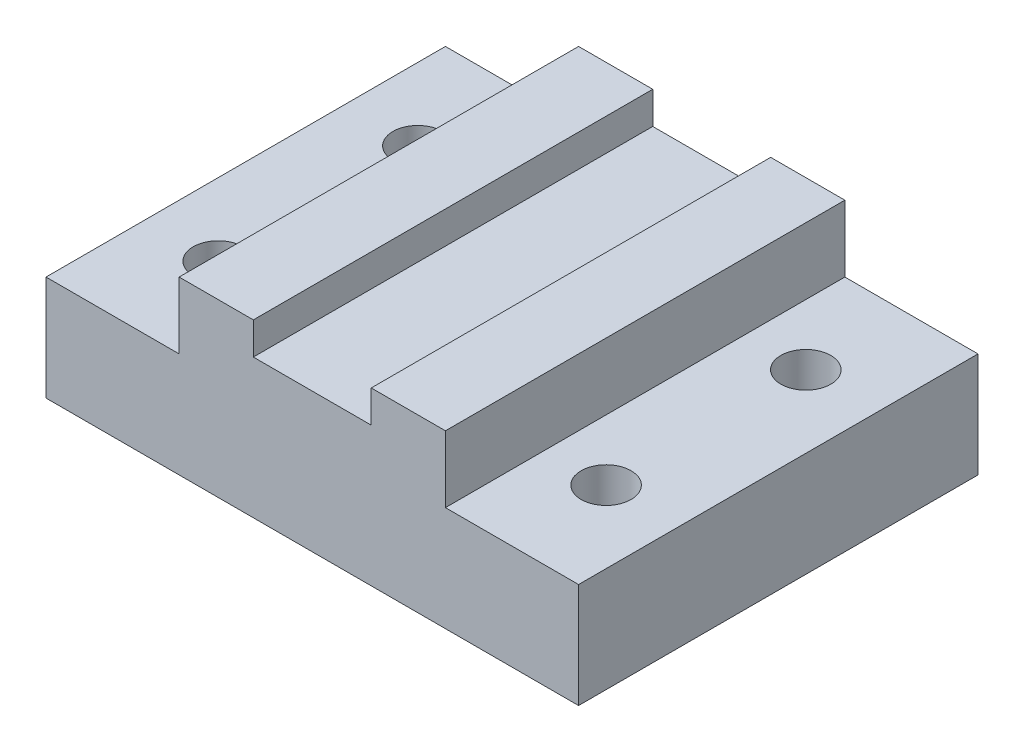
ISO-10303-21;
HEADER;
FILE_DESCRIPTION(('STEP AP214'),'2;1');
FILE_NAME('part.step','',(''),(''),'','','');
FILE_SCHEMA(('AUTOMOTIVE_DESIGN { 1 0 10303 214 1 1 1 1 }'));
ENDSEC;
DATA;
#1=APPLICATION_CONTEXT('core data for automotive mechanical design processes');
#2=APPLICATION_PROTOCOL_DEFINITION('international standard','automotive_design',2000,#1);
#3=PRODUCT_CONTEXT('',#1,'mechanical');
#4=PRODUCT('Part','Part','',(#3));
#5=PRODUCT_RELATED_PRODUCT_CATEGORY('part','',(#4));
#6=PRODUCT_DEFINITION_FORMATION('','',#4);
#7=PRODUCT_DEFINITION_CONTEXT('part definition',#1,'design');
#8=PRODUCT_DEFINITION('design','',#6,#7);
#9=PRODUCT_DEFINITION_SHAPE('','',#8);
#10=(LENGTH_UNIT() NAMED_UNIT(*) SI_UNIT(.MILLI.,.METRE.));
#11=(NAMED_UNIT(*) PLANE_ANGLE_UNIT() SI_UNIT($,.RADIAN.));
#12=(NAMED_UNIT(*) SI_UNIT($,.STERADIAN.) SOLID_ANGLE_UNIT());
#13=UNCERTAINTY_MEASURE_WITH_UNIT(LENGTH_MEASURE(1.E-05),#10,'distance_accuracy_value','');
#14=(GEOMETRIC_REPRESENTATION_CONTEXT(3) GLOBAL_UNCERTAINTY_ASSIGNED_CONTEXT((#13)) GLOBAL_UNIT_ASSIGNED_CONTEXT((#10,
#11,#12)) REPRESENTATION_CONTEXT('',''));
#15=CARTESIAN_POINT('',(0.,0.,0.));
#16=DIRECTION('',(0.,0.,1.));
#17=DIRECTION('',(1.,0.,0.));
#18=AXIS2_PLACEMENT_3D('',#15,#16,#17);
#19=CARTESIAN_POINT('',(50.8,65.4,-76.2));
#20=DIRECTION('',(0.,1.,0.));
#21=DIRECTION('',(-1.,0.,0.));
#22=AXIS2_PLACEMENT_3D('',#19,#20,#21);
#23=PLANE('',#22);
#24=DIRECTION('',(0.,0.,-1.));
#25=VECTOR('',#24,1.);
#26=CARTESIAN_POINT('',(22.4944704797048,65.4,-76.2));
#27=LINE('',#26,#25);
#28=CARTESIAN_POINT('',(22.4944704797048,65.4,76.2));
#29=VERTEX_POINT('',#28);
#30=CARTESIAN_POINT('',(22.4944704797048,65.4,-76.2));
#31=VERTEX_POINT('',#30);
#32=EDGE_CURVE('E11',#29,#31,#27,.T.);
#33=ORIENTED_EDGE('',*,*,#32,.F.);
#34=DIRECTION('',(1.,0.,0.));
#35=VECTOR('',#34,1.);
#36=CARTESIAN_POINT('',(50.8,65.4,76.2));
#37=LINE('',#36,#35);
#38=CARTESIAN_POINT('',(50.8,65.4,76.2));
#39=VERTEX_POINT('',#38);
#40=EDGE_CURVE('E252',#29,#39,#37,.T.);
#41=ORIENTED_EDGE('',*,*,#40,.T.);
#42=DIRECTION('',(0.,0.,-1.));
#43=VECTOR('',#42,1.);
#44=CARTESIAN_POINT('',(50.8,65.4,76.2));
#45=LINE('',#44,#43);
#46=CARTESIAN_POINT('',(50.8,65.4,-76.2));
#47=VERTEX_POINT('',#46);
#48=EDGE_CURVE('E257',#39,#47,#45,.T.);
#49=ORIENTED_EDGE('',*,*,#48,.T.);
#50=DIRECTION('',(-1.,0.,0.));
#51=VECTOR('',#50,1.);
#52=CARTESIAN_POINT('',(50.8,65.4,-76.2));
#53=LINE('',#52,#51);
#54=EDGE_CURVE('E255',#47,#31,#53,.T.);
#55=ORIENTED_EDGE('',*,*,#54,.T.);
#56=EDGE_LOOP('',(#33,#41,#49,#55));
#57=FACE_BOUND('',#56,.T.);
#58=ADVANCED_FACE('F29',(#57),#23,.T.);
#59=CARTESIAN_POINT('',(-101.6,40.,76.2));
#60=DIRECTION('',(0.,-1.,0.));
#61=DIRECTION('',(1.,0.,0.));
#62=AXIS2_PLACEMENT_3D('',#59,#60,#61);
#63=PLANE('',#62);
#64=CARTESIAN_POINT('',(74.0067888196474,40.,38.1));
#65=DIRECTION('',(0.,1.,0.));
#66=DIRECTION('',(1.,0.,0.));
#67=AXIS2_PLACEMENT_3D('',#64,#65,#66);
#68=CIRCLE('',#67,9.52500000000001);
#69=CARTESIAN_POINT('',(83.5317888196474,40.,38.1));
#70=VERTEX_POINT('',#69);
#71=EDGE_CURVE('E149',#70,#70,#68,.T.);
#72=ORIENTED_EDGE('',*,*,#71,.F.);
#73=EDGE_LOOP('',(#72));
#74=FACE_BOUND('',#73,.T.);
#75=CARTESIAN_POINT('',(74.0067888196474,40.,-38.1));
#76=DIRECTION('',(0.,1.,0.));
#77=DIRECTION('',(1.,0.,0.));
#78=AXIS2_PLACEMENT_3D('',#75,#76,#77);
#79=CIRCLE('',#78,9.52500000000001);
#80=CARTESIAN_POINT('',(83.5317888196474,40.,-38.1));
#81=VERTEX_POINT('',#80);
#82=EDGE_CURVE('E155',#81,#81,#79,.T.);
#83=ORIENTED_EDGE('',*,*,#82,.F.);
#84=EDGE_LOOP('',(#83));
#85=FACE_BOUND('',#84,.T.);
#86=DIRECTION('',(0.,0.,-1.));
#87=VECTOR('',#86,1.);
#88=CARTESIAN_POINT('',(50.8,40.,76.2));
#89=LINE('',#88,#87);
#90=CARTESIAN_POINT('',(50.8,40.,76.2));
#91=VERTEX_POINT('',#90);
#92=CARTESIAN_POINT('',(50.8,40.,-76.2));
#93=VERTEX_POINT('',#92);
#94=EDGE_CURVE('E52',#91,#93,#89,.T.);
#95=ORIENTED_EDGE('',*,*,#94,.F.);
#96=DIRECTION('',(-1.,0.,0.));
#97=VECTOR('',#96,1.);
#98=CARTESIAN_POINT('',(-101.6,40.,76.2));
#99=LINE('',#98,#97);
#100=CARTESIAN_POINT('',(101.6,40.,76.2));
#101=VERTEX_POINT('',#100);
#102=EDGE_CURVE('E226',#101,#91,#99,.T.);
#103=ORIENTED_EDGE('',*,*,#102,.F.);
#104=DIRECTION('',(0.,0.,-1.));
#105=VECTOR('',#104,1.);
#106=CARTESIAN_POINT('',(101.6,40.,76.2));
#107=LINE('',#106,#105);
#108=CARTESIAN_POINT('',(101.6,40.,-76.2));
#109=VERTEX_POINT('',#108);
#110=EDGE_CURVE('E197',#101,#109,#107,.T.);
#111=ORIENTED_EDGE('',*,*,#110,.T.);
#112=DIRECTION('',(-1.,0.,0.));
#113=VECTOR('',#112,1.);
#114=CARTESIAN_POINT('',(-101.6,40.,-76.2));
#115=LINE('',#114,#113);
#116=EDGE_CURVE('E201',#109,#93,#115,.T.);
#117=ORIENTED_EDGE('',*,*,#116,.T.);
#118=EDGE_LOOP('',(#95,#103,#111,#117));
#119=FACE_BOUND('',#118,.T.);
#120=ADVANCED_FACE('F281',(#74,#85,#119),#63,.F.);
#121=CARTESIAN_POINT('',(-74.0067888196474,40.,-38.1));
#122=DIRECTION('',(0.,1.,0.));
#123=DIRECTION('',(-1.,0.,0.));
#124=AXIS2_PLACEMENT_3D('',#121,#122,#123);
#125=CIRCLE('',#124,9.52500000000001);
#126=CARTESIAN_POINT('',(-83.5317888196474,40.,-38.1));
#127=VERTEX_POINT('',#126);
#128=EDGE_CURVE('E161',#127,#127,#125,.T.);
#129=ORIENTED_EDGE('',*,*,#128,.F.);
#130=EDGE_LOOP('',(#129));
#131=FACE_BOUND('',#130,.T.);
#132=CARTESIAN_POINT('',(-74.0067888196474,40.,38.1));
#133=DIRECTION('',(0.,1.,0.));
#134=DIRECTION('',(-1.,0.,0.));
#135=AXIS2_PLACEMENT_3D('',#132,#133,#134);
#136=CIRCLE('',#135,9.52500000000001);
#137=CARTESIAN_POINT('',(-83.5317888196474,40.,38.1));
#138=VERTEX_POINT('',#137);
#139=EDGE_CURVE('E167',#138,#138,#136,.T.);
#140=ORIENTED_EDGE('',*,*,#139,.F.);
#141=EDGE_LOOP('',(#140));
#142=FACE_BOUND('',#141,.T.);
#143=DIRECTION('',(0.,0.,1.));
#144=VECTOR('',#143,1.);
#145=CARTESIAN_POINT('',(-50.8,40.,76.2));
#146=LINE('',#145,#144);
#147=CARTESIAN_POINT('',(-50.8,40.,-76.2));
#148=VERTEX_POINT('',#147);
#149=CARTESIAN_POINT('',(-50.8,40.,76.2));
#150=VERTEX_POINT('',#149);
#151=EDGE_CURVE('E180',#148,#150,#146,.T.);
#152=ORIENTED_EDGE('',*,*,#151,.F.);
#153=CARTESIAN_POINT('',(-101.6,40.,-76.2));
#154=VERTEX_POINT('',#153);
#155=EDGE_CURVE('E205',#148,#154,#115,.T.);
#156=ORIENTED_EDGE('',*,*,#155,.T.);
#157=DIRECTION('',(0.,0.,-1.));
#158=VECTOR('',#157,1.);
#159=CARTESIAN_POINT('',(-101.6,40.,76.2));
#160=LINE('',#159,#158);
#161=CARTESIAN_POINT('',(-101.6,40.,76.2));
#162=VERTEX_POINT('',#161);
#163=EDGE_CURVE('E222',#162,#154,#160,.T.);
#164=ORIENTED_EDGE('',*,*,#163,.F.);
#165=EDGE_CURVE('E219',#150,#162,#99,.T.);
#166=ORIENTED_EDGE('',*,*,#165,.F.);
#167=EDGE_LOOP('',(#152,#156,#164,#166));
#168=FACE_BOUND('',#167,.T.);
#169=ADVANCED_FACE('F239',(#131,#142,#168),#63,.F.);
#170=CARTESIAN_POINT('',(-101.6,0.,76.2));
#171=DIRECTION('',(1.,0.,0.));
#172=DIRECTION('',(0.,0.,-1.));
#173=AXIS2_PLACEMENT_3D('',#170,#171,#172);
#174=PLANE('',#173);
#175=DIRECTION('',(0.,-1.,0.));
#176=VECTOR('',#175,1.);
#177=CARTESIAN_POINT('',(-101.6,0.,-76.2));
#178=LINE('',#177,#176);
#179=CARTESIAN_POINT('',(-101.6,0.,-76.2));
#180=VERTEX_POINT('',#179);
#181=EDGE_CURVE('E243',#154,#180,#178,.T.);
#182=ORIENTED_EDGE('',*,*,#181,.T.);
#183=DIRECTION('',(0.,0.,-1.));
#184=VECTOR('',#183,1.);
#185=CARTESIAN_POINT('',(-101.6,0.,76.2));
#186=LINE('',#185,#184);
#187=CARTESIAN_POINT('',(-101.6,0.,76.2));
#188=VERTEX_POINT('',#187);
#189=EDGE_CURVE('E189',#188,#180,#186,.T.);
#190=ORIENTED_EDGE('',*,*,#189,.F.);
#191=DIRECTION('',(0.,-1.,0.));
#192=VECTOR('',#191,1.);
#193=CARTESIAN_POINT('',(-101.6,0.,76.2));
#194=LINE('',#193,#192);
#195=EDGE_CURVE('E204',#162,#188,#194,.T.);
#196=ORIENTED_EDGE('',*,*,#195,.F.);
#197=ORIENTED_EDGE('',*,*,#163,.T.);
#198=EDGE_LOOP('',(#182,#190,#196,#197));
#199=FACE_BOUND('',#198,.T.);
#200=ADVANCED_FACE('F31',(#199),#174,.F.);
#201=CARTESIAN_POINT('',(-101.6,0.,76.2));
#202=DIRECTION('',(0.,1.,0.));
#203=DIRECTION('',(-1.,0.,0.));
#204=AXIS2_PLACEMENT_3D('',#201,#202,#203);
#205=PLANE('',#204);
#206=CARTESIAN_POINT('',(74.0067888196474,0.,38.1));
#207=DIRECTION('',(0.,1.,0.));
#208=DIRECTION('',(1.,0.,0.));
#209=AXIS2_PLACEMENT_3D('',#206,#207,#208);
#210=CIRCLE('',#209,9.52500000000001);
#211=CARTESIAN_POINT('',(83.5317888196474,0.,38.1));
#212=VERTEX_POINT('',#211);
#213=EDGE_CURVE('E152',#212,#212,#210,.T.);
#214=ORIENTED_EDGE('',*,*,#213,.T.);
#215=EDGE_LOOP('',(#214));
#216=FACE_BOUND('',#215,.T.);
#217=CARTESIAN_POINT('',(74.0067888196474,0.,-38.1));
#218=DIRECTION('',(0.,1.,0.));
#219=DIRECTION('',(1.,0.,0.));
#220=AXIS2_PLACEMENT_3D('',#217,#218,#219);
#221=CIRCLE('',#220,9.52500000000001);
#222=CARTESIAN_POINT('',(83.5317888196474,0.,-38.1));
#223=VERTEX_POINT('',#222);
#224=EDGE_CURVE('E158',#223,#223,#221,.T.);
#225=ORIENTED_EDGE('',*,*,#224,.T.);
#226=EDGE_LOOP('',(#225));
#227=FACE_BOUND('',#226,.T.);
#228=CARTESIAN_POINT('',(-74.0067888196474,0.,-38.1));
#229=DIRECTION('',(0.,1.,0.));
#230=DIRECTION('',(-1.,0.,0.));
#231=AXIS2_PLACEMENT_3D('',#228,#229,#230);
#232=CIRCLE('',#231,9.52500000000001);
#233=CARTESIAN_POINT('',(-83.5317888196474,0.,-38.1));
#234=VERTEX_POINT('',#233);
#235=EDGE_CURVE('E164',#234,#234,#232,.T.);
#236=ORIENTED_EDGE('',*,*,#235,.T.);
#237=EDGE_LOOP('',(#236));
#238=FACE_BOUND('',#237,.T.);
#239=CARTESIAN_POINT('',(-74.0067888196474,0.,38.1));
#240=DIRECTION('',(0.,1.,0.));
#241=DIRECTION('',(-1.,0.,0.));
#242=AXIS2_PLACEMENT_3D('',#239,#240,#241);
#243=CIRCLE('',#242,9.52500000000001);
#244=CARTESIAN_POINT('',(-83.5317888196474,0.,38.1));
#245=VERTEX_POINT('',#244);
#246=EDGE_CURVE('E170',#245,#245,#243,.T.);
#247=ORIENTED_EDGE('',*,*,#246,.T.);
#248=EDGE_LOOP('',(#247));
#249=FACE_BOUND('',#248,.T.);
#250=DIRECTION('',(1.,0.,0.));
#251=VECTOR('',#250,1.);
#252=CARTESIAN_POINT('',(-101.6,0.,-76.2));
#253=LINE('',#252,#251);
#254=CARTESIAN_POINT('',(101.6,0.,-76.2));
#255=VERTEX_POINT('',#254);
#256=EDGE_CURVE('E244',#180,#255,#253,.T.);
#257=ORIENTED_EDGE('',*,*,#256,.T.);
#258=DIRECTION('',(0.,0.,-1.));
#259=VECTOR('',#258,1.);
#260=CARTESIAN_POINT('',(101.6,0.,76.2));
#261=LINE('',#260,#259);
#262=CARTESIAN_POINT('',(101.6,0.,76.2));
#263=VERTEX_POINT('',#262);
#264=EDGE_CURVE('E191',#263,#255,#261,.T.);
#265=ORIENTED_EDGE('',*,*,#264,.F.);
#266=DIRECTION('',(1.,0.,0.));
#267=VECTOR('',#266,1.);
#268=CARTESIAN_POINT('',(-101.6,0.,76.2));
#269=LINE('',#268,#267);
#270=EDGE_CURVE('E215',#188,#263,#269,.T.);
#271=ORIENTED_EDGE('',*,*,#270,.F.);
#272=ORIENTED_EDGE('',*,*,#189,.T.);
#273=EDGE_LOOP('',(#257,#265,#271,#272));
#274=FACE_BOUND('',#273,.T.);
#275=ADVANCED_FACE('F336',(#216,#227,#238,#249,#274),#205,.F.);
#276=CARTESIAN_POINT('',(101.6,0.,76.2));
#277=DIRECTION('',(-1.,0.,0.));
#278=DIRECTION('',(0.,-1.,0.));
#279=AXIS2_PLACEMENT_3D('',#276,#277,#278);
#280=PLANE('',#279);
#281=DIRECTION('',(0.,1.,0.));
#282=VECTOR('',#281,1.);
#283=CARTESIAN_POINT('',(101.6,0.,-76.2));
#284=LINE('',#283,#282);
#285=EDGE_CURVE('E210',#255,#109,#284,.T.);
#286=ORIENTED_EDGE('',*,*,#285,.T.);
#287=ORIENTED_EDGE('',*,*,#110,.F.);
#288=DIRECTION('',(0.,1.,0.));
#289=VECTOR('',#288,1.);
#290=CARTESIAN_POINT('',(101.6,0.,76.2));
#291=LINE('',#290,#289);
#292=EDGE_CURVE('E217',#263,#101,#291,.T.);
#293=ORIENTED_EDGE('',*,*,#292,.F.);
#294=ORIENTED_EDGE('',*,*,#264,.T.);
#295=EDGE_LOOP('',(#286,#287,#293,#294));
#296=FACE_BOUND('',#295,.T.);
#297=ADVANCED_FACE('F277',(#296),#280,.F.);
#298=CARTESIAN_POINT('',(-101.6,40.,76.2));
#299=DIRECTION('',(0.,0.,-1.));
#300=DIRECTION('',(-1.,0.,0.));
#301=AXIS2_PLACEMENT_3D('',#298,#299,#300);
#302=PLANE('',#301);
#303=ORIENTED_EDGE('',*,*,#40,.F.);
#304=DIRECTION('',(0.,-1.,0.));
#305=VECTOR('',#304,1.);
#306=CARTESIAN_POINT('',(22.4944704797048,40.,76.2));
#307=LINE('',#306,#305);
#308=CARTESIAN_POINT('',(22.4944704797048,53.1116616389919,76.2));
#309=VERTEX_POINT('',#308);
#310=EDGE_CURVE('E146',#29,#309,#307,.T.);
#311=ORIENTED_EDGE('',*,*,#310,.T.);
#312=DIRECTION('',(-1.,0.,0.));
#313=VECTOR('',#312,1.);
#314=CARTESIAN_POINT('',(-101.6,53.1116616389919,76.2));
#315=LINE('',#314,#313);
#316=CARTESIAN_POINT('',(-22.4944704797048,53.1116616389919,76.2));
#317=VERTEX_POINT('',#316);
#318=EDGE_CURVE('E125',#309,#317,#315,.T.);
#319=ORIENTED_EDGE('',*,*,#318,.T.);
#320=DIRECTION('',(0.,1.,0.));
#321=VECTOR('',#320,1.);
#322=CARTESIAN_POINT('',(-22.4944704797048,40.,76.2));
#323=LINE('',#322,#321);
#324=CARTESIAN_POINT('',(-22.4944704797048,65.4,76.2));
#325=VERTEX_POINT('',#324);
#326=EDGE_CURVE('E142',#317,#325,#323,.T.);
#327=ORIENTED_EDGE('',*,*,#326,.T.);
#328=CARTESIAN_POINT('',(-50.8,65.4,76.2));
#329=VERTEX_POINT('',#328);
#330=EDGE_CURVE('E187',#329,#325,#37,.T.);
#331=ORIENTED_EDGE('',*,*,#330,.F.);
#332=DIRECTION('',(0.,-1.,0.));
#333=VECTOR('',#332,1.);
#334=CARTESIAN_POINT('',(-50.8,65.4,76.2));
#335=LINE('',#334,#333);
#336=EDGE_CURVE('E186',#329,#150,#335,.T.);
#337=ORIENTED_EDGE('',*,*,#336,.T.);
#338=ORIENTED_EDGE('',*,*,#165,.T.);
#339=ORIENTED_EDGE('',*,*,#195,.T.);
#340=ORIENTED_EDGE('',*,*,#270,.T.);
#341=ORIENTED_EDGE('',*,*,#292,.T.);
#342=ORIENTED_EDGE('',*,*,#102,.T.);
#343=DIRECTION('',(0.,-1.,0.));
#344=VECTOR('',#343,1.);
#345=CARTESIAN_POINT('',(50.8,65.4,76.2));
#346=LINE('',#345,#344);
#347=EDGE_CURVE('E183',#39,#91,#346,.T.);
#348=ORIENTED_EDGE('',*,*,#347,.F.);
#349=EDGE_LOOP('',(#303,#311,#319,#327,#331,#337,#338,#339,#340,#341,#342,#348));
#350=FACE_BOUND('',#349,.T.);
#351=ADVANCED_FACE('F233',(#350),#302,.F.);
#352=CARTESIAN_POINT('',(-101.6,40.,-76.2));
#353=DIRECTION('',(0.,0.,-1.));
#354=DIRECTION('',(-1.,0.,0.));
#355=AXIS2_PLACEMENT_3D('',#352,#353,#354);
#356=PLANE('',#355);
#357=DIRECTION('',(0.,-1.,0.));
#358=VECTOR('',#357,1.);
#359=CARTESIAN_POINT('',(22.4944704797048,65.4,-76.2));
#360=LINE('',#359,#358);
#361=CARTESIAN_POINT('',(22.4944704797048,53.1116616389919,-76.2));
#362=VERTEX_POINT('',#361);
#363=EDGE_CURVE('E131',#31,#362,#360,.T.);
#364=ORIENTED_EDGE('',*,*,#363,.F.);
#365=ORIENTED_EDGE('',*,*,#54,.F.);
#366=DIRECTION('',(0.,-1.,0.));
#367=VECTOR('',#366,1.);
#368=CARTESIAN_POINT('',(50.8,65.4,-76.2));
#369=LINE('',#368,#367);
#370=EDGE_CURVE('E245',#47,#93,#369,.T.);
#371=ORIENTED_EDGE('',*,*,#370,.T.);
#372=ORIENTED_EDGE('',*,*,#116,.F.);
#373=ORIENTED_EDGE('',*,*,#285,.F.);
#374=ORIENTED_EDGE('',*,*,#256,.F.);
#375=ORIENTED_EDGE('',*,*,#181,.F.);
#376=ORIENTED_EDGE('',*,*,#155,.F.);
#377=DIRECTION('',(0.,-1.,0.));
#378=VECTOR('',#377,1.);
#379=CARTESIAN_POINT('',(-50.8,65.4,-76.2));
#380=LINE('',#379,#378);
#381=CARTESIAN_POINT('',(-50.8,65.4,-76.2));
#382=VERTEX_POINT('',#381);
#383=EDGE_CURVE('E248',#382,#148,#380,.T.);
#384=ORIENTED_EDGE('',*,*,#383,.F.);
#385=CARTESIAN_POINT('',(-22.4944704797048,65.4,-76.2));
#386=VERTEX_POINT('',#385);
#387=EDGE_CURVE('E256',#386,#382,#53,.T.);
#388=ORIENTED_EDGE('',*,*,#387,.F.);
#389=DIRECTION('',(0.,1.,0.));
#390=VECTOR('',#389,1.);
#391=CARTESIAN_POINT('',(-22.4944704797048,65.4,-76.2));
#392=LINE('',#391,#390);
#393=CARTESIAN_POINT('',(-22.4944704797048,53.1116616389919,-76.2));
#394=VERTEX_POINT('',#393);
#395=EDGE_CURVE('E44',#394,#386,#392,.T.);
#396=ORIENTED_EDGE('',*,*,#395,.F.);
#397=DIRECTION('',(-1.,0.,0.));
#398=VECTOR('',#397,1.);
#399=CARTESIAN_POINT('',(22.4944704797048,53.1116616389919,-76.2));
#400=LINE('',#399,#398);
#401=EDGE_CURVE('E123',#362,#394,#400,.T.);
#402=ORIENTED_EDGE('',*,*,#401,.F.);
#403=EDGE_LOOP('',(#364,#365,#371,#372,#373,#374,#375,#376,#384,#388,#396,#402));
#404=FACE_BOUND('',#403,.T.);
#405=ADVANCED_FACE('F137',(#404),#356,.T.);
#406=CARTESIAN_POINT('',(50.8,65.4,76.2));
#407=DIRECTION('',(-1.,0.,0.));
#408=DIRECTION('',(0.,-1.,0.));
#409=AXIS2_PLACEMENT_3D('',#406,#407,#408);
#410=PLANE('',#409);
#411=ORIENTED_EDGE('',*,*,#94,.T.);
#412=ORIENTED_EDGE('',*,*,#370,.F.);
#413=ORIENTED_EDGE('',*,*,#48,.F.);
#414=ORIENTED_EDGE('',*,*,#347,.T.);
#415=EDGE_LOOP('',(#411,#412,#413,#414));
#416=FACE_BOUND('',#415,.T.);
#417=ADVANCED_FACE('F283',(#416),#410,.F.);
#418=CARTESIAN_POINT('',(-50.8,65.4,76.2));
#419=DIRECTION('',(1.,0.,0.));
#420=DIRECTION('',(0.,1.,0.));
#421=AXIS2_PLACEMENT_3D('',#418,#419,#420);
#422=PLANE('',#421);
#423=ORIENTED_EDGE('',*,*,#151,.T.);
#424=ORIENTED_EDGE('',*,*,#336,.F.);
#425=DIRECTION('',(0.,0.,1.));
#426=VECTOR('',#425,1.);
#427=CARTESIAN_POINT('',(-50.8,65.4,76.2));
#428=LINE('',#427,#426);
#429=EDGE_CURVE('E253',#382,#329,#428,.T.);
#430=ORIENTED_EDGE('',*,*,#429,.F.);
#431=ORIENTED_EDGE('',*,*,#383,.T.);
#432=EDGE_LOOP('',(#423,#424,#430,#431));
#433=FACE_BOUND('',#432,.T.);
#434=ADVANCED_FACE('F272',(#433),#422,.F.);
#435=DIRECTION('',(0.,0.,1.));
#436=VECTOR('',#435,1.);
#437=CARTESIAN_POINT('',(-22.4944704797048,65.4,-76.2));
#438=LINE('',#437,#436);
#439=EDGE_CURVE('E37',#386,#325,#438,.T.);
#440=ORIENTED_EDGE('',*,*,#439,.F.);
#441=ORIENTED_EDGE('',*,*,#387,.T.);
#442=ORIENTED_EDGE('',*,*,#429,.T.);
#443=ORIENTED_EDGE('',*,*,#330,.T.);
#444=EDGE_LOOP('',(#440,#441,#442,#443));
#445=FACE_BOUND('',#444,.T.);
#446=ADVANCED_FACE('F286',(#445),#23,.T.);
#447=CARTESIAN_POINT('',(-74.0067888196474,0.,38.1));
#448=DIRECTION('',(0.,1.,0.));
#449=DIRECTION('',(-1.,0.,0.));
#450=AXIS2_PLACEMENT_3D('',#447,#448,#449);
#451=CYLINDRICAL_SURFACE('',#450,9.52500000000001);
#452=ORIENTED_EDGE('',*,*,#246,.F.);
#453=EDGE_LOOP('',(#452));
#454=FACE_BOUND('',#453,.T.);
#455=ORIENTED_EDGE('',*,*,#139,.T.);
#456=EDGE_LOOP('',(#455));
#457=FACE_BOUND('',#456,.T.);
#458=ADVANCED_FACE('F295',(#454,#457),#451,.F.);
#459=CARTESIAN_POINT('',(-74.0067888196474,0.,-38.1));
#460=DIRECTION('',(0.,1.,0.));
#461=DIRECTION('',(-1.,0.,0.));
#462=AXIS2_PLACEMENT_3D('',#459,#460,#461);
#463=CYLINDRICAL_SURFACE('',#462,9.52500000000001);
#464=ORIENTED_EDGE('',*,*,#235,.F.);
#465=EDGE_LOOP('',(#464));
#466=FACE_BOUND('',#465,.T.);
#467=ORIENTED_EDGE('',*,*,#128,.T.);
#468=EDGE_LOOP('',(#467));
#469=FACE_BOUND('',#468,.T.);
#470=ADVANCED_FACE('F301',(#466,#469),#463,.F.);
#471=CARTESIAN_POINT('',(74.0067888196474,0.,-38.1));
#472=DIRECTION('',(0.,1.,0.));
#473=DIRECTION('',(-1.,0.,0.));
#474=AXIS2_PLACEMENT_3D('',#471,#472,#473);
#475=CYLINDRICAL_SURFACE('',#474,9.52500000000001);
#476=ORIENTED_EDGE('',*,*,#224,.F.);
#477=EDGE_LOOP('',(#476));
#478=FACE_BOUND('',#477,.T.);
#479=ORIENTED_EDGE('',*,*,#82,.T.);
#480=EDGE_LOOP('',(#479));
#481=FACE_BOUND('',#480,.T.);
#482=ADVANCED_FACE('F316',(#478,#481),#475,.F.);
#483=CARTESIAN_POINT('',(74.0067888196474,0.,38.1));
#484=DIRECTION('',(0.,1.,0.));
#485=DIRECTION('',(-1.,0.,0.));
#486=AXIS2_PLACEMENT_3D('',#483,#484,#485);
#487=CYLINDRICAL_SURFACE('',#486,9.52500000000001);
#488=ORIENTED_EDGE('',*,*,#213,.F.);
#489=EDGE_LOOP('',(#488));
#490=FACE_BOUND('',#489,.T.);
#491=ORIENTED_EDGE('',*,*,#71,.T.);
#492=EDGE_LOOP('',(#491));
#493=FACE_BOUND('',#492,.T.);
#494=ADVANCED_FACE('F312',(#490,#493),#487,.F.);
#495=CARTESIAN_POINT('',(22.4944704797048,53.1116616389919,76.20005));
#496=DIRECTION('',(0.,-1.,0.));
#497=DIRECTION('',(0.,0.,-1.));
#498=AXIS2_PLACEMENT_3D('',#495,#496,#497);
#499=PLANE('',#498);
#500=DIRECTION('',(0.,0.,-1.));
#501=VECTOR('',#500,1.);
#502=CARTESIAN_POINT('',(22.4944704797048,53.1116616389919,76.20005));
#503=LINE('',#502,#501);
#504=EDGE_CURVE('E118',#309,#362,#503,.T.);
#505=ORIENTED_EDGE('',*,*,#504,.T.);
#506=ORIENTED_EDGE('',*,*,#401,.T.);
#507=DIRECTION('',(0.,0.,-1.));
#508=VECTOR('',#507,1.);
#509=CARTESIAN_POINT('',(-22.4944704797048,53.1116616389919,76.20005));
#510=LINE('',#509,#508);
#511=EDGE_CURVE('E128',#317,#394,#510,.T.);
#512=ORIENTED_EDGE('',*,*,#511,.F.);
#513=ORIENTED_EDGE('',*,*,#318,.F.);
#514=EDGE_LOOP('',(#505,#506,#512,#513));
#515=FACE_BOUND('',#514,.T.);
#516=ADVANCED_FACE('F120',(#515),#499,.F.);
#517=CARTESIAN_POINT('',(22.4944704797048,65.4,76.20005));
#518=DIRECTION('',(1.,0.,0.));
#519=DIRECTION('',(0.,0.,-1.));
#520=AXIS2_PLACEMENT_3D('',#517,#518,#519);
#521=PLANE('',#520);
#522=ORIENTED_EDGE('',*,*,#32,.T.);
#523=ORIENTED_EDGE('',*,*,#363,.T.);
#524=ORIENTED_EDGE('',*,*,#504,.F.);
#525=ORIENTED_EDGE('',*,*,#310,.F.);
#526=EDGE_LOOP('',(#522,#523,#524,#525));
#527=FACE_BOUND('',#526,.T.);
#528=ADVANCED_FACE('F132',(#527),#521,.F.);
#529=CARTESIAN_POINT('',(-22.4944704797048,65.4,76.20005));
#530=DIRECTION('',(-1.,0.,0.));
#531=DIRECTION('',(0.,0.,1.));
#532=AXIS2_PLACEMENT_3D('',#529,#530,#531);
#533=PLANE('',#532);
#534=ORIENTED_EDGE('',*,*,#511,.T.);
#535=ORIENTED_EDGE('',*,*,#395,.T.);
#536=ORIENTED_EDGE('',*,*,#439,.T.);
#537=ORIENTED_EDGE('',*,*,#326,.F.);
#538=EDGE_LOOP('',(#534,#535,#536,#537));
#539=FACE_BOUND('',#538,.T.);
#540=ADVANCED_FACE('F303',(#539),#533,.F.);
#541=CLOSED_SHELL('',(#58,#120,#169,#200,#275,#297,#351,#405,#417,#434,#446,#458,#470,#482,#494,
#516,#528,#540));
#542=MANIFOLD_SOLID_BREP('B2',#541);
#543=ADVANCED_BREP_SHAPE_REPRESENTATION('',(#18,#542),#14);
#544=SHAPE_DEFINITION_REPRESENTATION(#9,#543);
ENDSEC;
END-ISO-10303-21;
